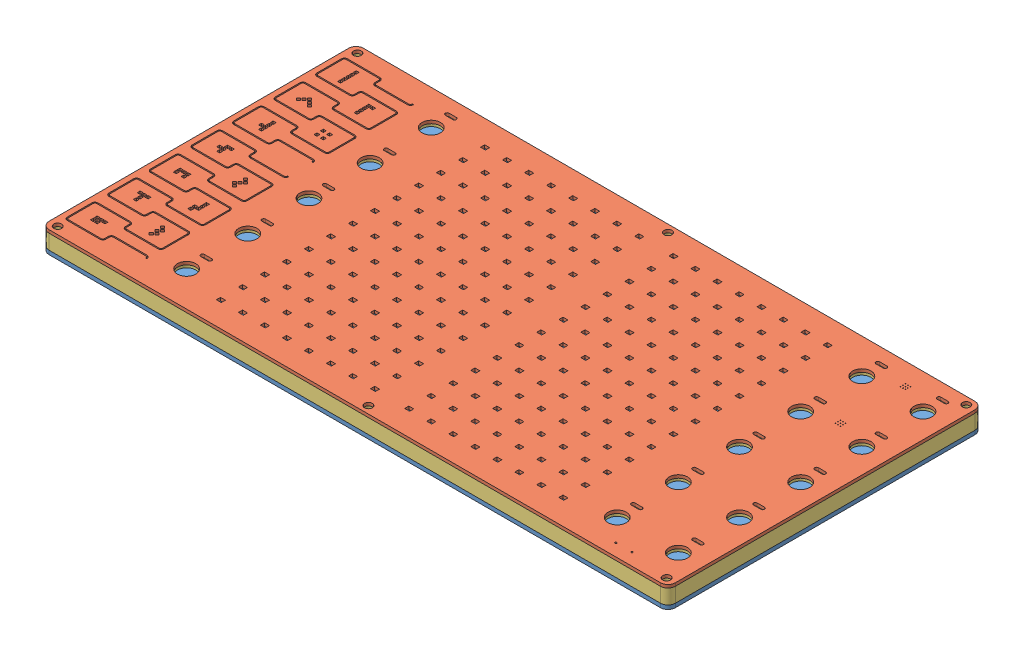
SolidWorks assembly Assem5.SLDASM, configuration Default (file format 9000). Lengths in mm.
Overall size (295.49 187.14 208.3).
3 component instances, 3 part files, 9 mates.
Components (placement in the parent):
- Matrix_V2_Base-1: Matrix_V2_Base.SLDPRT [Default] at (-2.509 44.8614 -103.4763) x (0.973442 -0.16396 -0.159772) z (0.210783 0.914239 0.346032) size (269.11 141.75 98.98)
- Matrix_V2-1: Matrix_V2.SLDPRT [Default] at (0 7.6 -128.5) x (1 0 0) z (0 1 0) size (256 128.5 1.26)
- Matrix_V2_3DP-1: Matrix_V2_3DP.SLDPRT [Default] at (0 6 -128.5) size (256 6 128.5)
Mates (geometry in assembly coordinates):
- Coincident7: coincident anti-aligned: plane of Matrix_V2_Base-1 through (128 0 -64.25) normal (0 -1 0); plane of assembly
- Coincident8: coincident aligned: plane of Matrix_V2_Base-1 through (253 0 0) normal (0 0 1); plane of assembly
- Coincident9: coincident anti-aligned: plane of Matrix_V2_Base-1 through (0 0 -3) normal (-1 0 0); plane of assembly
- Concentric5: concentric aligned: cylinder of Matrix_V2_Base-1 through (3.54 0 -3) axis (0 -1 0) radius 1.6; cylinder of Matrix_V2-1 through (3.54 7.1 -3) axis (0 -1 0) radius 1.6
- Concentric6: concentric aligned: cylinder of Matrix_V2_Base-1 through (252.46 0 -3) axis (0 -1 0) radius 1.6; cylinder of Matrix_V2-1 through (252.46 7.1 -3) axis (0 -1 0) radius 1.6
- Distance3: distance = 6 mm anti-aligned: plane of Matrix_V2_Base-1 through (128 1.6 -64.25) normal (0 1 0); plane of Matrix_V2-1 through (128 7.6 -64.25) normal (0 -1 0)
- Coincident10: coincident: plane of Matrix_V2_Base-1 through (128 1.6 -64.25) normal (0 1 0); plane of Matrix_V2_3DP-1 through (253 1.6 -3) normal (0 -1 0)
- Concentric7: concentric: cylinder of Matrix_V2_Base-1 through (3.54 0 -3) axis (0 -1 0) radius 1.6; cylinder of Matrix_V2_3DP-1 through (3.54 7.6 -3) axis (0 -1 0) radius 1.6
- Concentric8: concentric aligned: cylinder of Matrix_V2_Base-1 through (252.46 0 -3) axis (0 -1 0) radius 1.6; cylinder of Matrix_V2_3DP-1 through (252.46 7.6 -3) axis (0 -1 0) radius 1.6
